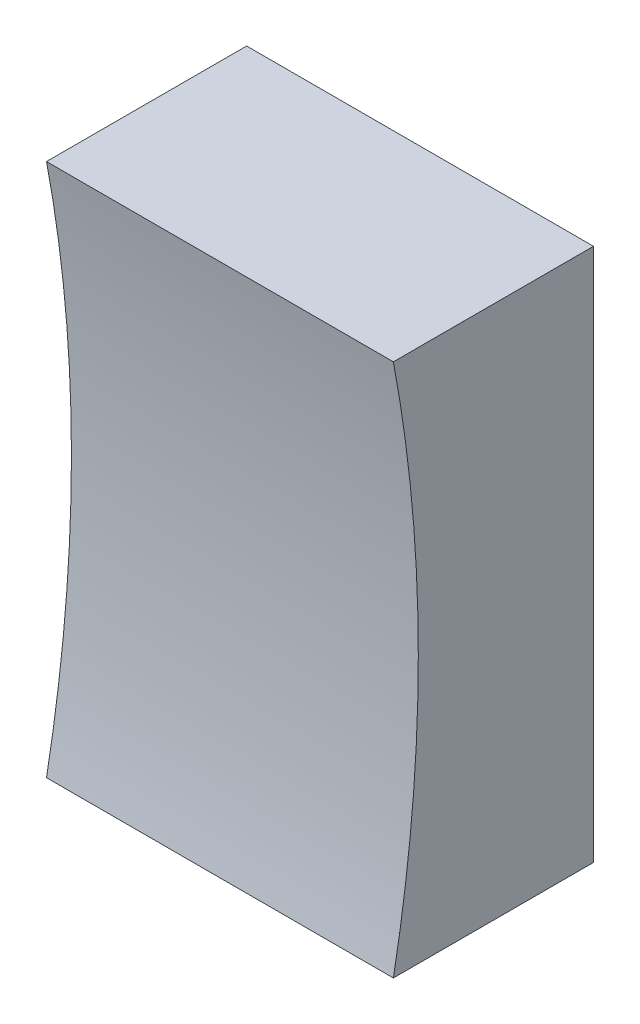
ISO-10303-21;
HEADER;
FILE_DESCRIPTION(('STEP AP214'),'2;1');
FILE_NAME('part.step','',(''),(''),'','','');
FILE_SCHEMA(('AUTOMOTIVE_DESIGN { 1 0 10303 214 1 1 1 1 }'));
ENDSEC;
DATA;
#1=APPLICATION_CONTEXT('core data for automotive mechanical design processes');
#2=APPLICATION_PROTOCOL_DEFINITION('international standard','automotive_design',2000,#1);
#3=PRODUCT_CONTEXT('',#1,'mechanical');
#4=PRODUCT('Part','Part','',(#3));
#5=PRODUCT_RELATED_PRODUCT_CATEGORY('part','',(#4));
#6=PRODUCT_DEFINITION_FORMATION('','',#4);
#7=PRODUCT_DEFINITION_CONTEXT('part definition',#1,'design');
#8=PRODUCT_DEFINITION('design','',#6,#7);
#9=PRODUCT_DEFINITION_SHAPE('','',#8);
#10=(LENGTH_UNIT() NAMED_UNIT(*) SI_UNIT(.MILLI.,.METRE.));
#11=(NAMED_UNIT(*) PLANE_ANGLE_UNIT() SI_UNIT($,.RADIAN.));
#12=(NAMED_UNIT(*) SI_UNIT($,.STERADIAN.) SOLID_ANGLE_UNIT());
#13=UNCERTAINTY_MEASURE_WITH_UNIT(LENGTH_MEASURE(1.E-05),#10,'distance_accuracy_value','');
#14=(GEOMETRIC_REPRESENTATION_CONTEXT(3) GLOBAL_UNCERTAINTY_ASSIGNED_CONTEXT((#13)) GLOBAL_UNIT_ASSIGNED_CONTEXT((#10,
#11,#12)) REPRESENTATION_CONTEXT('',''));
#15=CARTESIAN_POINT('',(0.,0.,0.));
#16=DIRECTION('',(0.,0.,1.));
#17=DIRECTION('',(1.,0.,0.));
#18=AXIS2_PLACEMENT_3D('',#15,#16,#17);
#19=CARTESIAN_POINT('',(-1.651,-2.54000000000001,1.90500000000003));
#20=DIRECTION('',(0.999999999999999,0.,0.));
#21=DIRECTION('',(0.,0.,-1.));
#22=AXIS2_PLACEMENT_3D('',#19,#20,#21);
#23=PLANE('',#22);
#24=DIRECTION('',(0.,0.,-0.999999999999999));
#25=VECTOR('',#24,1.);
#26=CARTESIAN_POINT('',(-1.651,-2.54000000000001,1.90500000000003));
#27=LINE('',#26,#25);
#28=CARTESIAN_POINT('',(-1.651,-2.54000000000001,1.90500000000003));
#29=VERTEX_POINT('',#28);
#30=CARTESIAN_POINT('',(-1.651,-2.53999999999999,0.));
#31=VERTEX_POINT('',#30);
#32=EDGE_CURVE('E11',#29,#31,#27,.T.);
#33=ORIENTED_EDGE('',*,*,#32,.F.);
#34=CARTESIAN_POINT('',(-1.651,0.,15.3837631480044));
#35=DIRECTION('',(1.,0.,0.));
#36=DIRECTION('',(0.,0.,-1.));
#37=AXIS2_PLACEMENT_3D('',#34,#35,#36);
#38=CIRCLE('',#37,13.716);
#39=CARTESIAN_POINT('',(-1.651,2.54,1.90500000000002));
#40=VERTEX_POINT('',#39);
#41=EDGE_CURVE('E46',#29,#40,#38,.T.);
#42=ORIENTED_EDGE('',*,*,#41,.T.);
#43=DIRECTION('',(0.,0.,-0.999999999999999));
#44=VECTOR('',#43,1.);
#45=CARTESIAN_POINT('',(-1.651,2.54,1.90500000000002));
#46=LINE('',#45,#44);
#47=CARTESIAN_POINT('',(-1.651,2.54,0.));
#48=VERTEX_POINT('',#47);
#49=EDGE_CURVE('E86',#40,#48,#46,.T.);
#50=ORIENTED_EDGE('',*,*,#49,.T.);
#51=DIRECTION('',(0.,-1.,0.));
#52=VECTOR('',#51,1.);
#53=CARTESIAN_POINT('',(-1.651,-2.53999999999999,0.));
#54=LINE('',#53,#52);
#55=EDGE_CURVE('E99',#48,#31,#54,.T.);
#56=ORIENTED_EDGE('',*,*,#55,.T.);
#57=EDGE_LOOP('',(#33,#42,#50,#56));
#58=FACE_BOUND('',#57,.T.);
#59=ADVANCED_FACE('F32',(#58),#23,.F.);
#60=CARTESIAN_POINT('',(-1.651,-2.54000000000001,1.90500000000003));
#61=DIRECTION('',(0.,0.999999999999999,0.));
#62=DIRECTION('',(0.,0.,1.));
#63=AXIS2_PLACEMENT_3D('',#60,#61,#62);
#64=PLANE('',#63);
#65=DIRECTION('',(1.,0.,0.));
#66=VECTOR('',#65,1.);
#67=CARTESIAN_POINT('',(-1.651,-2.53999999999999,0.));
#68=LINE('',#67,#66);
#69=CARTESIAN_POINT('',(1.651,-2.53999999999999,0.));
#70=VERTEX_POINT('',#69);
#71=EDGE_CURVE('E97',#31,#70,#68,.T.);
#72=ORIENTED_EDGE('',*,*,#71,.T.);
#73=DIRECTION('',(0.,0.,-0.999999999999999));
#74=VECTOR('',#73,1.);
#75=CARTESIAN_POINT('',(1.651,-2.54,1.90500000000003));
#76=LINE('',#75,#74);
#77=CARTESIAN_POINT('',(1.651,-2.54,1.90500000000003));
#78=VERTEX_POINT('',#77);
#79=EDGE_CURVE('E39',#78,#70,#76,.T.);
#80=ORIENTED_EDGE('',*,*,#79,.F.);
#81=DIRECTION('',(1.,0.,0.));
#82=VECTOR('',#81,1.);
#83=CARTESIAN_POINT('',(-1.651,-2.54000000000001,1.90500000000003));
#84=LINE('',#83,#82);
#85=EDGE_CURVE('E77',#29,#78,#84,.T.);
#86=ORIENTED_EDGE('',*,*,#85,.F.);
#87=ORIENTED_EDGE('',*,*,#32,.T.);
#88=EDGE_LOOP('',(#72,#80,#86,#87));
#89=FACE_BOUND('',#88,.T.);
#90=ADVANCED_FACE('F106',(#89),#64,.F.);
#91=CARTESIAN_POINT('',(1.651,-2.54,1.90500000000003));
#92=DIRECTION('',(-0.999999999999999,0.,0.));
#93=DIRECTION('',(0.,0.,1.));
#94=AXIS2_PLACEMENT_3D('',#91,#92,#93);
#95=PLANE('',#94);
#96=DIRECTION('',(0.,0.,-0.999999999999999));
#97=VECTOR('',#96,1.);
#98=CARTESIAN_POINT('',(1.65099999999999,2.54,1.90500000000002));
#99=LINE('',#98,#97);
#100=CARTESIAN_POINT('',(1.65099999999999,2.54,1.90500000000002));
#101=VERTEX_POINT('',#100);
#102=CARTESIAN_POINT('',(1.651,2.53999999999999,0.));
#103=VERTEX_POINT('',#102);
#104=EDGE_CURVE('E82',#101,#103,#99,.T.);
#105=ORIENTED_EDGE('',*,*,#104,.F.);
#106=CARTESIAN_POINT('',(1.651,0.,15.3837631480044));
#107=DIRECTION('',(1.,0.,0.));
#108=DIRECTION('',(0.,0.,-1.));
#109=AXIS2_PLACEMENT_3D('',#106,#107,#108);
#110=CIRCLE('',#109,13.716);
#111=EDGE_CURVE('E72',#78,#101,#110,.T.);
#112=ORIENTED_EDGE('',*,*,#111,.F.);
#113=ORIENTED_EDGE('',*,*,#79,.T.);
#114=DIRECTION('',(0.,1.,0.));
#115=VECTOR('',#114,1.);
#116=CARTESIAN_POINT('',(1.651,-2.53999999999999,0.));
#117=LINE('',#116,#115);
#118=EDGE_CURVE('E85',#70,#103,#117,.T.);
#119=ORIENTED_EDGE('',*,*,#118,.T.);
#120=EDGE_LOOP('',(#105,#112,#113,#119));
#121=FACE_BOUND('',#120,.T.);
#122=ADVANCED_FACE('F83',(#121),#95,.F.);
#123=CARTESIAN_POINT('',(-1.651,2.54,1.90500000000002));
#124=DIRECTION('',(0.,-0.999999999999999,0.));
#125=DIRECTION('',(0.,0.,-1.));
#126=AXIS2_PLACEMENT_3D('',#123,#124,#125);
#127=PLANE('',#126);
#128=DIRECTION('',(-1.,0.,0.));
#129=VECTOR('',#128,1.);
#130=CARTESIAN_POINT('',(-1.651,2.54,0.));
#131=LINE('',#130,#129);
#132=EDGE_CURVE('E54',#103,#48,#131,.T.);
#133=ORIENTED_EDGE('',*,*,#132,.T.);
#134=ORIENTED_EDGE('',*,*,#49,.F.);
#135=DIRECTION('',(-1.,0.,0.));
#136=VECTOR('',#135,1.);
#137=CARTESIAN_POINT('',(-1.651,2.54,1.90500000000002));
#138=LINE('',#137,#136);
#139=EDGE_CURVE('E76',#101,#40,#138,.T.);
#140=ORIENTED_EDGE('',*,*,#139,.F.);
#141=ORIENTED_EDGE('',*,*,#104,.T.);
#142=EDGE_LOOP('',(#133,#134,#140,#141));
#143=FACE_BOUND('',#142,.T.);
#144=ADVANCED_FACE('F88',(#143),#127,.F.);
#145=CARTESIAN_POINT('',(-1.651,2.54,0.));
#146=DIRECTION('',(0.,0.,-1.));
#147=DIRECTION('',(-1.,0.,0.));
#148=AXIS2_PLACEMENT_3D('',#145,#146,#147);
#149=PLANE('',#148);
#150=ORIENTED_EDGE('',*,*,#55,.F.);
#151=ORIENTED_EDGE('',*,*,#132,.F.);
#152=ORIENTED_EDGE('',*,*,#118,.F.);
#153=ORIENTED_EDGE('',*,*,#71,.F.);
#154=EDGE_LOOP('',(#150,#151,#152,#153));
#155=FACE_BOUND('',#154,.T.);
#156=ADVANCED_FACE('F96',(#155),#149,.T.);
#157=CARTESIAN_POINT('',(-1.651,0.,15.3837631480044));
#158=DIRECTION('',(1.,0.,0.));
#159=DIRECTION('',(0.,0.,-1.));
#160=AXIS2_PLACEMENT_3D('',#157,#158,#159);
#161=CYLINDRICAL_SURFACE('',#160,13.716);
#162=ORIENTED_EDGE('',*,*,#41,.F.);
#163=ORIENTED_EDGE('',*,*,#85,.T.);
#164=ORIENTED_EDGE('',*,*,#111,.T.);
#165=ORIENTED_EDGE('',*,*,#139,.T.);
#166=EDGE_LOOP('',(#162,#163,#164,#165));
#167=FACE_BOUND('',#166,.T.);
#168=ADVANCED_FACE('F74',(#167),#161,.F.);
#169=CLOSED_SHELL('',(#59,#90,#122,#144,#156,#168));
#170=MANIFOLD_SOLID_BREP('B2',#169);
#171=ADVANCED_BREP_SHAPE_REPRESENTATION('',(#18,#170),#14);
#172=SHAPE_DEFINITION_REPRESENTATION(#9,#171);
ENDSEC;
END-ISO-10303-21;
